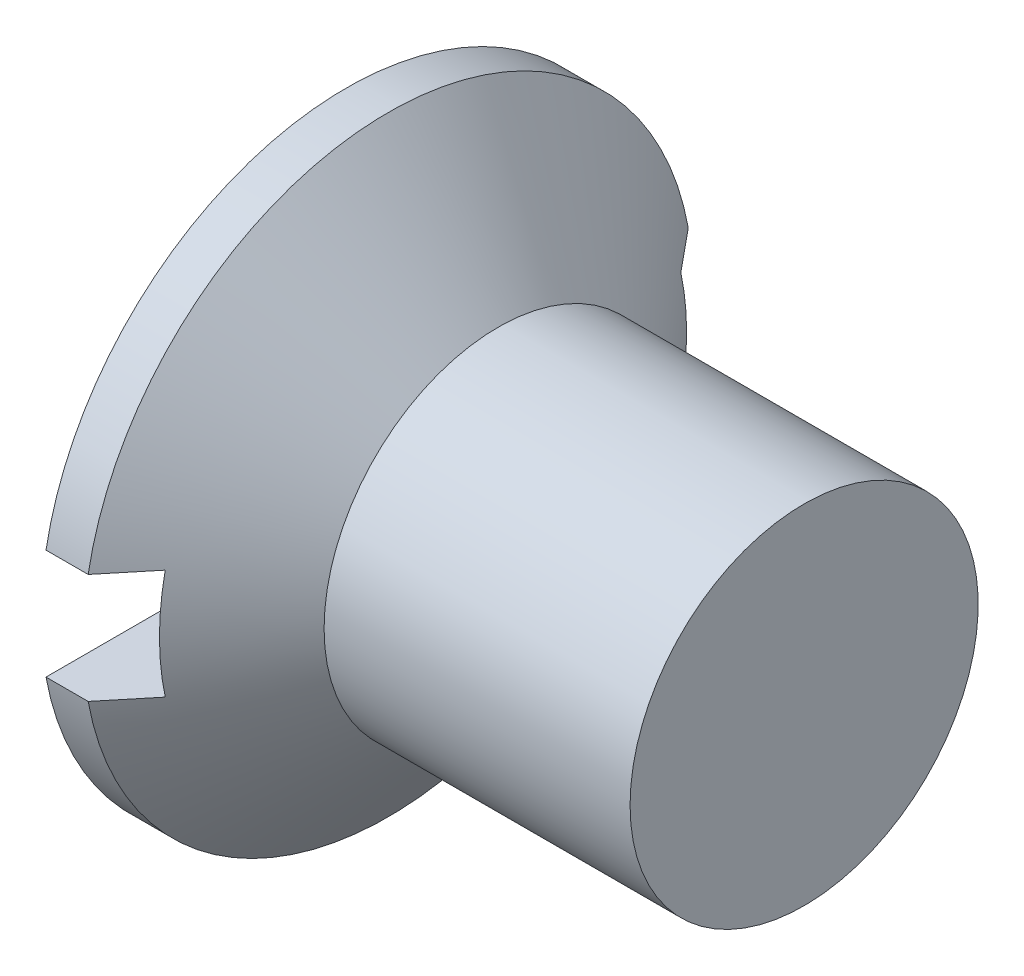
from build123d import *

# Parameters (mm, degrees)
SKETCH2_W         = 8.4582
SKETCH2_H         = 1.524
SLOT_DEPTH        = 1.0668
CIRPATTERN1_COUNT = 2
CIRPATTERN1_ANGLE = 90


with BuildPart() as part:
    # BodySke → Base-Revolve (revolve)
    with BuildSketch(Plane.XY, mode=Mode.PRIVATE) as base_revolve_sk:
        Polygon((0, 0), (0, 4.2291), (0.58431116, 4.2291), (2.1082, 2.413), (6.35, 2.413), (6.35, 0), align=None)
    revolve(base_revolve_sk.sketch.rotate(Axis((-6.35, 0, 0), (1, 0, 0)), 90), axis=Axis((-6.35, 0, 0), (1, 0, 0)))

    # Sketch2 → Slot (cut)
    with BuildSketch(Plane.ZY):
        Rectangle(SKETCH2_W, SKETCH2_H)
    extrude(amount=-SLOT_DEPTH, mode=Mode.SUBTRACT)

    # Sketch3 → Cross section 0
    with BuildSketch(Plane.ZY):
        with BuildLine():
            Line((-0.5334, 2.8575), (0.5334, 2.8575))
            Line((0.5334, 2.8575), (0.5334, -2.8575))
            Line((0.5334, -2.8575), (-0.5334, -2.8575))
            Line((-0.5334, -2.8575), (-0.5334, 2.8575))
        make_face()
    # Sketch4 → Cross section 1
    with BuildSketch(Plane.ZY.offset(-3.7338)):
        with BuildLine():
            Line((-0.2667, 0.2667), (0.2667, 0.2667))
            Line((0.2667, 0.2667), (0.2667, -0.2667))
            Line((0.2667, -0.2667), (-0.2667, -0.2667))
            Line((-0.2667, -0.2667), (-0.2667, 0.2667))
        make_face()
    cross = loft(mode=Mode.SUBTRACT)

    # CirPattern1: Cross ×2 about axis
    cirpattern1_axis = Axis((0, 0, 0), (1, 0, 0))
    for i in range(1, CIRPATTERN1_COUNT):
        add(cross.rotate(cirpattern1_axis, i * CIRPATTERN1_ANGLE / (CIRPATTERN1_COUNT - 1)), mode=Mode.SUBTRACT)


solid = part.part
